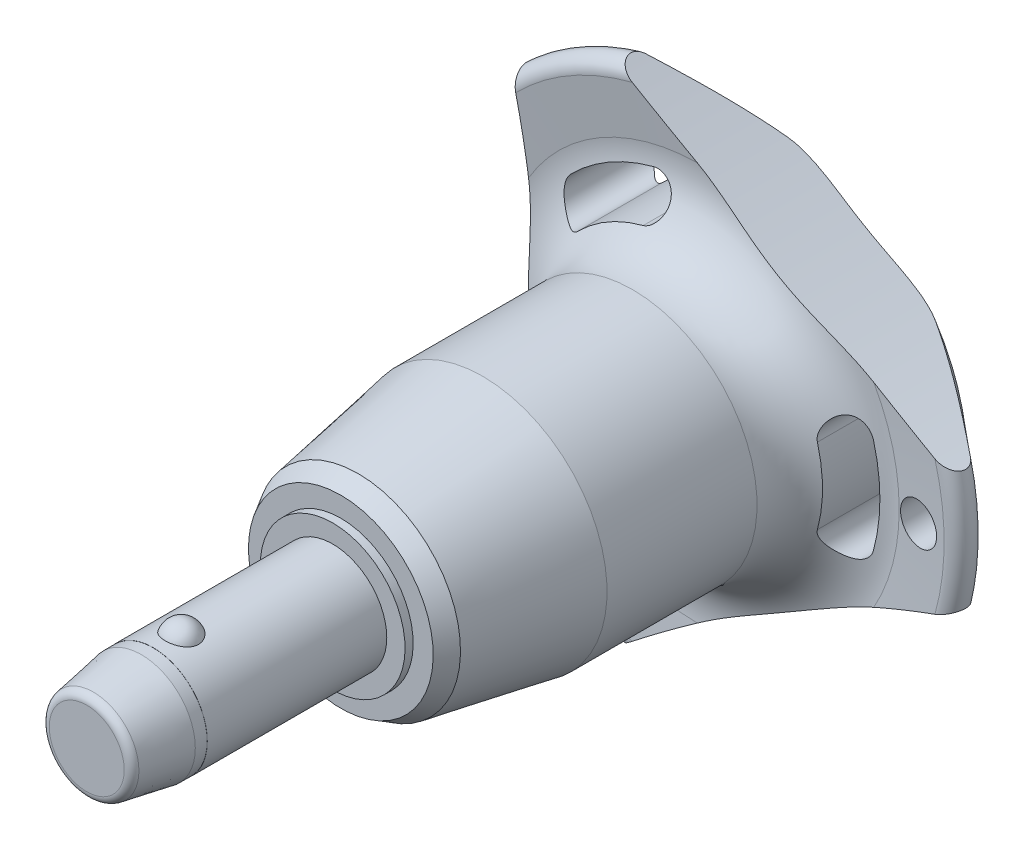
from build123d import *

# Parameters (mm, degrees)
SKETCH1_R           = 4
BOSS_EXTRUDE1_DEPTH = 10
SKETCH2_R           = 3.4
BOSS_EXTRUDE2_DEPTH = 33.3
BOSS_EXTRUDE3_START = 8.2
SKETCH1_2_R         = 4
BOSS_EXTRUDE3_DEPTH = 8.2
CHAMFER1_SIZE       = 4.1
CHAMFER1_SIZE2      = 0.722940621
FILLET1_R           = 0.6
SKETCH6_R           = 102.8
CUT_EXTRUDE1_DEPTH  = 52.415192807
CIRPATTERN1_COUNT   = 3
SKETCH7_R           = 1.5
CUT_EXTRUDE2_DEPTH  = 52.099652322
SKETCH8_R           = 4
SKETCH8_R_2         = 3.99
CUT_EXTRUDE3_DEPTH  = 4.92


with BuildPart() as part:
    # Sketch1 → Boss-Extrude1 (new body)
    with BuildSketch(Plane.XY):
        Circle(SKETCH1_R)
    extrude(amount=-BOSS_EXTRUDE1_DEPTH)

    # Sketch2 → Boss-Extrude2 (add)
    with BuildSketch(Plane(origin=(0, 0, -10), x_dir=(-1, 0, 0), z_dir=(0, 0, -1))):
        Circle(SKETCH2_R)
    extrude(amount=BOSS_EXTRUDE2_DEPTH)

    # Sketch3 → Revolve1 (revolve)
    with BuildSketch(Plane(origin=(0, 0, 0), x_dir=(0, 0, -1), z_dir=(1, 0, 0))):
        with BuildLine():
            Line((-1.2, 4.8), (-1.2, 2.2))
            ThreePointArc((-1.2, 2.2), (0.1, 3.5), (-1.2, 4.8))
        make_face()
        with BuildLine():
            Line((-1.2, -2.2), (-1.2, -4.8))
            ThreePointArc((-1.2, -4.8), (0.1, -3.5), (-1.2, -2.2))
        make_face()
    revolve(axis=Axis((0, -2.2, 1.2), (0, 1, 0)))

    # Sketch1_2 → Boss-Extrude3 (add)
    with BuildSketch(Plane.XY.offset(BOSS_EXTRUDE3_START)):
        Circle(SKETCH1_2_R)
    extrude(amount=-BOSS_EXTRUDE3_DEPTH)

    # Chamfer1
    chamfer1_edges = [part.edges().sort_by_distance(p)[0] for p in [
        (-4, 0, 8.2),
    ]]
    chamfer1_side = [part.faces().sort_by_distance(p)[0] for p in [
        (-4, 0, -0.9),
    ]]
    chamfer(chamfer1_edges, length=CHAMFER1_SIZE, length2=CHAMFER1_SIZE2, reference=chamfer1_side[0])

    # Fillet1
    fillet1_edges = [part.edges().sort_by_distance(p)[0] for p in [
        (-3.277059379, 0, 8.2),
        (3.4, 0, -43.3),
    ]]
    fillet(fillet1_edges, radius=FILLET1_R)

    # Sketch4 → Revolve2 (revolve)
    with BuildSketch(Plane(origin=(0, 0, 0), x_dir=(0, 0, -1), z_dir=(1, 0, 0))):
        Polygon((10, 0), (10, 5.353660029), (10.6, 5.353660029), (10.6, 6.834334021), (11.882301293, 7.574671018), (21.1, 9.2), (32.2, 9.2), (32.2, 0), align=None)
    revolve(axis=Axis((0, 0, -32.2), (0, 0, 1)))

    # Sketch5 → Revolve3 (revolve)
    with BuildSketch(Plane(origin=(0, 0, 0), x_dir=(0, 0, -1), z_dir=(1, 0, 0)), mode=Mode.PRIVATE) as revolve3_sk:
        with BuildLine():
            Line((37.169704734, 14.749576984), (36.756059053, 18.490084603))
            ThreePointArc((36.756059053, 18.490084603), (37.35677658, 19.519442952), (38.516044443, 19.24278761))
            Line((38.516044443, 19.24278761), (42.835691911, 14.094832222))
            ThreePointArc((42.835691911, 14.094832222), (43.3, 12.689260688), (42.67067517, 11.349423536))
            ThreePointArc((42.67067517, 11.349423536), (39.033110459, 6.185112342), (37.75, 0))
            Line((37.75, 0), (32.2, 0))
            Line((32.2, 0), (32.2, 9.2))
            ThreePointArc((32.2, 9.2), (35.924774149, 10.864425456), (37.169704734, 14.749576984))
        make_face()
    revolve(revolve3_sk.sketch.rotate(Axis((0, 0, -37.75), (0, 0, 1)), 90), axis=Axis((0, 0, -37.75), (0, 0, 1)))

    # Sketch6 → Cut-Extrude1 (cut, through all)
    with BuildSketch(Plane.XY):
        with Locations((-115.2, 0)):
            Circle(SKETCH6_R)
        with BuildLine():
            ThreePointArc((12.885043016, -3.538869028), (13.362182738, 0), (12.885043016, 3.538869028))
            ThreePointArc((12.885043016, 3.538869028), (11.179749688, 4.509281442), (10.209337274, 2.803988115))
            ThreePointArc((10.209337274, 2.803988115), (10.587394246, 0), (10.209337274, -2.803988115))
            ThreePointArc((10.209337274, -2.803988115), (11.179749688, -4.509281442), (12.885043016, -3.538869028))
        make_face()
    cut_extrude1 = extrude(amount=-CUT_EXTRUDE1_DEPTH, mode=Mode.SUBTRACT)

    # CirPattern1: Cut-Extrude1 ×3 about axis
    cirpattern1_axis = Axis((0, 0, 0), (0, 0, 1))
    for i in range(1, CIRPATTERN1_COUNT):
        add(cut_extrude1.rotate(cirpattern1_axis, i * 360 / CIRPATTERN1_COUNT), mode=Mode.SUBTRACT)

    # Sketch7 → Cut-Extrude2 (cut, through all)
    with BuildSketch(Plane.XY):
        with Locations(Location((16.362182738, 0, 0), (0, 0, 225.449470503))):
            Circle(SKETCH7_R)
    extrude(amount=-CUT_EXTRUDE2_DEPTH, mode=Mode.SUBTRACT)

    # Sketch8 → Cut-Extrude3 (cut)
    with BuildSketch(Plane.XY.offset(8.2)):
        Circle(SKETCH8_R)
        Circle(SKETCH8_R_2, mode=Mode.SUBTRACT)
    extrude(amount=-CUT_EXTRUDE3_DEPTH, mode=Mode.SUBTRACT)


solid = part.part
